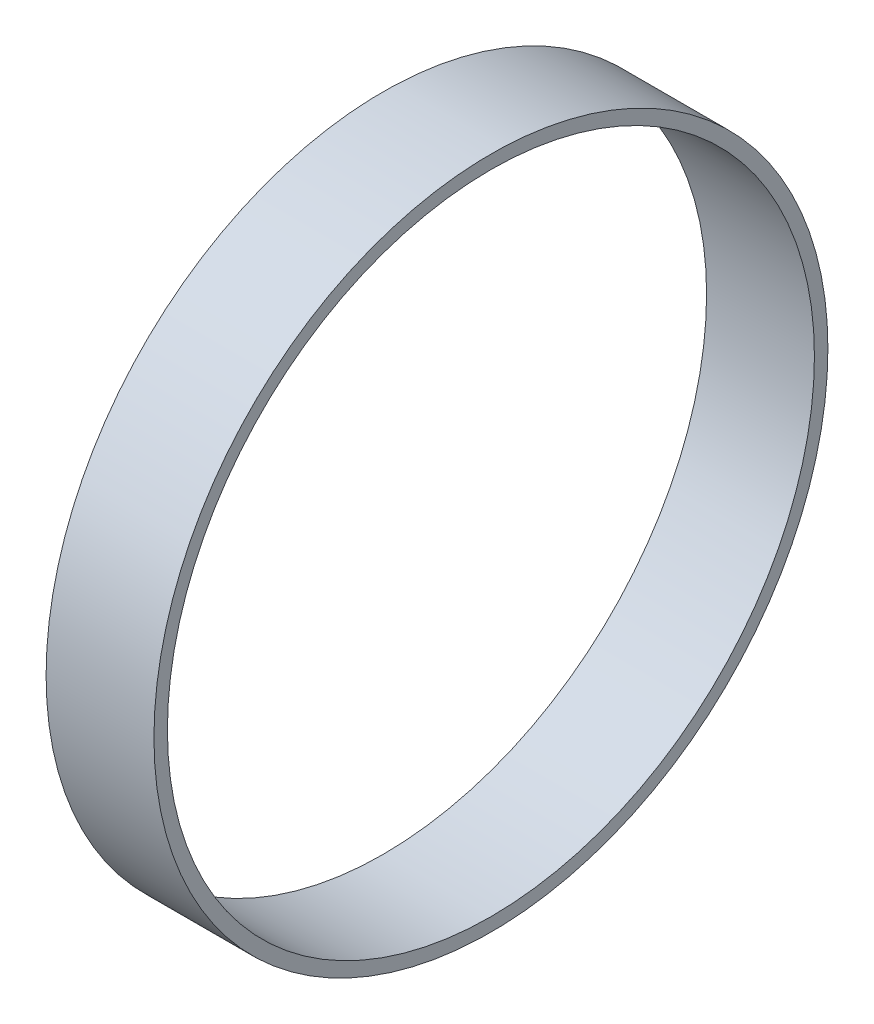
from build123d import *

# Parameters (mm, degrees)
ESQUISSE1_R      = 25
ESQUISSE1_R_2    = 24
EXTRUSION1_DEPTH = 8


with BuildPart() as part:
    # Esquisse1 → Extrusion1 (new body)
    with BuildSketch(Plane(origin=(0, 0, 0), x_dir=(0, 0, -1), z_dir=(1, 0, 0))):
        Circle(ESQUISSE1_R)
        Circle(ESQUISSE1_R_2, mode=Mode.SUBTRACT)
    extrude(amount=EXTRUSION1_DEPTH)


solid = part.part
